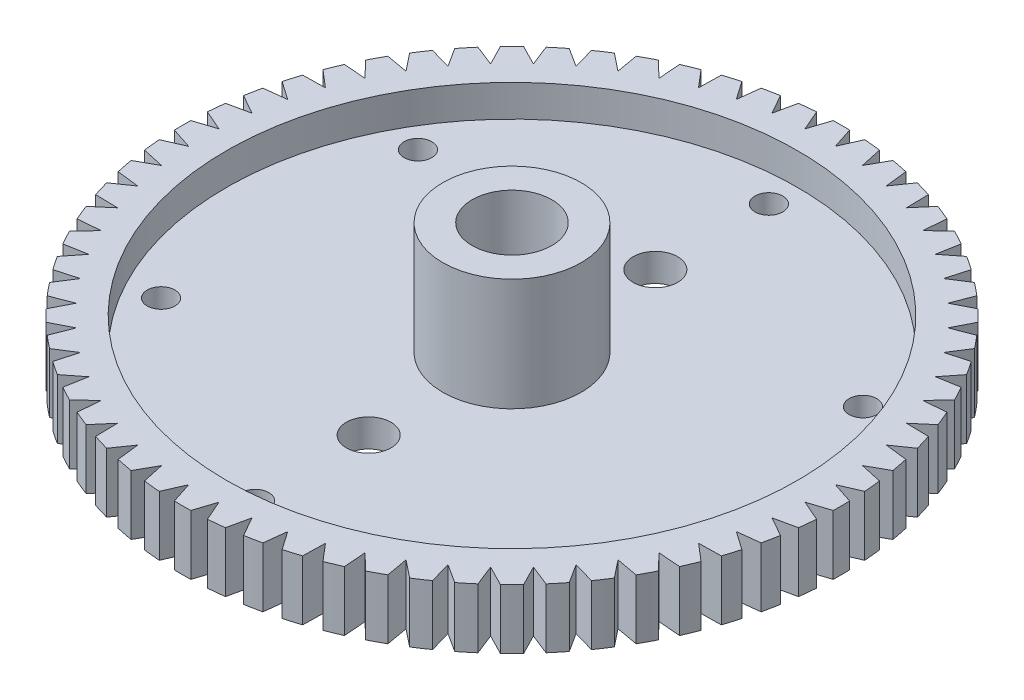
from build123d import *

# Parameters (mm, degrees)
SKETCH1_R           = 3.175
SKETCH1_R_2         = 1.1049
BOSS_EXTRUDE1_DEPTH = 4.7625
SKETCH2_R           = 5.5245
SKETCH2_R_2         = 3.175
BOSS_EXTRUDE2_DEPTH = 11.176
CUT_EXTRUDE2_START  = -2.54
SKETCH3_R           = 22.7711
SKETCH3_R_2         = 5.5245
CUT_EXTRUDE2_DEPTH  = 2.54
SKETCH4_R           = 1.778
CUT_EXTRUDE3_DEPTH  = 39.222050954


with BuildPart() as part:
    # Sketch1 → Boss-Extrude1 (new body)
    with BuildSketch(Plane(origin=(0, 0, 0), x_dir=(1, 0, 0), z_dir=(0, 1, 0))):
        with BuildLine():
            Line((-1.208701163, 24.570187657), (-0.656995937, 26.266217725))
            ThreePointArc((-0.656995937, 26.266217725), (0, 26.275071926), (0.657011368, 26.267448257))
            Line((0.657011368, 26.267448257), (1.205418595, 24.570348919))
            Line((1.205418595, 24.570348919), (1.920707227, 26.20413557))
            ThreePointArc((1.920707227, 26.20413557), (2.575407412, 26.148550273), (3.228507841, 26.076564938))
            Line((3.228507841, 26.076564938), (3.607929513, 24.33388429))
            Line((3.607929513, 24.33388429), (4.47991293, 25.889693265))
            ThreePointArc((4.47991293, 25.889693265), (5.126012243, 25.770203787), (5.768912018, 25.634550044))
            Line((5.768912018, 25.634550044), (5.975694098, 23.863071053))
            Line((5.975694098, 23.863071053), (6.995974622, 25.325919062))
            ThreePointArc((6.995974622, 25.325919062), (7.627250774, 25.14367615), (8.253758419, 24.94566042))
            Line((8.253758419, 24.94566042), (8.285909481, 23.162443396))
            Line((8.285909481, 23.162443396), (9.444661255, 24.518242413))
            ThreePointArc((9.444661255, 24.518242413), (10.05503471, 24.275001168), (10.659116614, 24.01653045))
            Line((10.659116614, 24.01653045), (10.516327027, 22.238748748))
            Line((10.516327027, 22.238748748), (11.802390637, 23.474441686))
            ThreePointArc((11.802390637, 23.474441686), (12.385983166, 23.172544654), (12.961821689, 22.856108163))
            Line((12.961821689, 22.856108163), (12.645466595, 21.100882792))
            Line((12.645466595, 21.100882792), (14.046456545, 22.204569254))
            ThreePointArc((14.046456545, 22.204569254), (14.597647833, 21.846923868), (15.139697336, 21.475569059))
            Line((15.139697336, 21.475569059), (14.652823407, 19.7598038))
            Line((14.652823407, 19.7598038), (16.155247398, 20.720854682))
            ThreePointArc((16.155247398, 20.720854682), (16.668729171, 20.310905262), (17.171769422, 19.888208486))
            Line((17.171769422, 19.888208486), (16.519065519, 18.228427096))
            Line((16.519065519, 18.228427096), (18.108454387, 19.037586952))
            ThreePointArc((18.108454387, 19.037586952), (18.579281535, 18.579281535), (19.03846798, 18.109313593))
            Line((19.03846798, 18.109313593), (18.22622, 16.521500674))
            Line((18.22622, 16.521500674), (19.887267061, 17.170976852))
            ThreePointArc((19.887267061, 17.170976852), (20.310905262, 16.668729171), (20.721815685, 16.15601611))
            Line((20.721815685, 16.15601611), (19.757846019, 14.655463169))
            Line((19.757846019, 14.655463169), (21.474554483, 15.139000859))
            ThreePointArc((21.474554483, 15.139000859), (21.846923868, 14.597647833), (22.205600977, 14.047127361))
            Line((22.205600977, 14.047127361), (21.09919318, 12.648285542))
            Line((21.09919318, 12.648285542), (22.855030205, 12.961228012))
            ThreePointArc((22.855030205, 12.961228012), (23.172544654, 12.385983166), (23.475534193, 11.802957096))
            Line((23.475534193, 11.802957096), (22.237343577, 10.519298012))
            Line((22.237343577, 10.519298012), (24.015399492, 10.658631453))
            ThreePointArc((24.015399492, 10.658631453), (24.275001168, 10.05503471), (24.519385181, 9.445117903))
            Line((24.519385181, 9.445117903), (23.161336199, 8.289003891))
            Line((23.161336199, 8.289003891), (24.944487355, 8.253386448))
            ThreePointArc((24.944487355, 8.253386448), (25.14367615, 7.627250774), (25.327101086, 6.99631706))
            Line((25.327101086, 6.99631706), (23.862272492, 5.978882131))
            Line((23.862272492, 5.978882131), (25.633346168, 5.768656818))
            ThreePointArc((25.633346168, 5.768656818), (25.770203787, 5.126012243), (25.890903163, 4.48013786))
            Line((25.890903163, 4.48013786), (24.333402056, 3.611180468))
            Line((24.333402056, 3.611180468), (26.075341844, 3.228371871))
            ThreePointArc((26.075341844, 3.228371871), (26.148550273, 2.575407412), (26.205361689, 1.920812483))
            Line((26.205361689, 1.920812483), (24.570187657, 1.208701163))
            Line((24.570187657, 1.208701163), (26.266217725, 0.656995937))
            ThreePointArc((26.266217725, 0.656995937), (26.275071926, 0), (26.267448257, -0.657011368))
            Line((26.267448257, -0.657011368), (24.570348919, -1.205418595))
            Line((24.570348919, -1.205418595), (26.20413557, -1.920707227))
            ThreePointArc((26.20413557, -1.920707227), (26.148550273, -2.575407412), (26.076564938, -3.228507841))
            Line((26.076564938, -3.228507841), (24.33388429, -3.607929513))
            Line((24.33388429, -3.607929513), (25.889693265, -4.47991293))
            ThreePointArc((25.889693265, -4.47991293), (25.770203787, -5.126012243), (25.634550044, -5.768912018))
            Line((25.634550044, -5.768912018), (23.863071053, -5.975694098))
            Line((23.863071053, -5.975694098), (25.325919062, -6.995974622))
            ThreePointArc((25.325919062, -6.995974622), (25.14367615, -7.627250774), (24.94566042, -8.253758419))
            Line((24.94566042, -8.253758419), (23.162443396, -8.285909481))
            Line((23.162443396, -8.285909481), (24.518242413, -9.444661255))
            ThreePointArc((24.518242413, -9.444661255), (24.275001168, -10.05503471), (24.01653045, -10.659116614))
            Line((24.01653045, -10.659116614), (22.238748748, -10.516327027))
            Line((22.238748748, -10.516327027), (23.474441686, -11.802390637))
            ThreePointArc((23.474441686, -11.802390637), (23.172544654, -12.385983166), (22.856108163, -12.961821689))
            Line((22.856108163, -12.961821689), (21.100882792, -12.645466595))
            Line((21.100882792, -12.645466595), (22.204569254, -14.046456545))
            ThreePointArc((22.204569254, -14.046456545), (21.846923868, -14.597647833), (21.475569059, -15.139697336))
            Line((21.475569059, -15.139697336), (19.7598038, -14.652823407))
            Line((19.7598038, -14.652823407), (20.720854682, -16.155247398))
            ThreePointArc((20.720854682, -16.155247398), (20.310905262, -16.668729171), (19.888208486, -17.171769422))
            Line((19.888208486, -17.171769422), (18.228427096, -16.519065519))
            Line((18.228427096, -16.519065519), (19.037586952, -18.108454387))
            ThreePointArc((19.037586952, -18.108454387), (18.579281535, -18.579281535), (18.109313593, -19.03846798))
            Line((18.109313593, -19.03846798), (16.521500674, -18.22622))
            Line((16.521500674, -18.22622), (17.170976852, -19.887267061))
            ThreePointArc((17.170976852, -19.887267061), (16.668729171, -20.310905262), (16.15601611, -20.721815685))
            Line((16.15601611, -20.721815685), (14.655463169, -19.757846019))
            Line((14.655463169, -19.757846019), (15.139000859, -21.474554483))
            ThreePointArc((15.139000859, -21.474554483), (14.597647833, -21.846923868), (14.047127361, -22.205600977))
            Line((14.047127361, -22.205600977), (12.648285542, -21.09919318))
            Line((12.648285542, -21.09919318), (12.961228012, -22.855030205))
            ThreePointArc((12.961228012, -22.855030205), (12.385983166, -23.172544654), (11.802957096, -23.475534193))
            Line((11.802957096, -23.475534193), (10.519298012, -22.237343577))
            Line((10.519298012, -22.237343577), (10.658631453, -24.015399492))
            ThreePointArc((10.658631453, -24.015399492), (10.05503471, -24.275001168), (9.445117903, -24.519385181))
            Line((9.445117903, -24.519385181), (8.289003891, -23.161336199))
            Line((8.289003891, -23.161336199), (8.253386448, -24.944487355))
            ThreePointArc((8.253386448, -24.944487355), (7.627250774, -25.14367615), (6.99631706, -25.327101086))
            Line((6.99631706, -25.327101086), (5.978882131, -23.862272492))
            Line((5.978882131, -23.862272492), (5.768656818, -25.633346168))
            ThreePointArc((5.768656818, -25.633346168), (5.126012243, -25.770203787), (4.48013786, -25.890903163))
            Line((4.48013786, -25.890903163), (3.611180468, -24.333402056))
            Line((3.611180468, -24.333402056), (3.228371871, -26.075341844))
            ThreePointArc((3.228371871, -26.075341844), (2.575407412, -26.148550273), (1.920812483, -26.205361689))
            Line((1.920812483, -26.205361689), (1.208701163, -24.570187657))
            Line((1.208701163, -24.570187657), (0.656995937, -26.266217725))
            ThreePointArc((0.656995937, -26.266217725), (0, -26.275071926), (-0.657011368, -26.267448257))
            Line((-0.657011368, -26.267448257), (-1.205418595, -24.570348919))
            Line((-1.205418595, -24.570348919), (-1.920707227, -26.20413557))
            ThreePointArc((-1.920707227, -26.20413557), (-2.575407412, -26.148550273), (-3.228507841, -26.076564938))
            Line((-3.228507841, -26.076564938), (-3.607929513, -24.33388429))
            Line((-3.607929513, -24.33388429), (-4.47991293, -25.889693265))
            ThreePointArc((-4.47991293, -25.889693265), (-5.126012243, -25.770203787), (-5.768912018, -25.634550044))
            Line((-5.768912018, -25.634550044), (-5.975694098, -23.863071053))
            Line((-5.975694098, -23.863071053), (-6.995974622, -25.325919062))
            ThreePointArc((-6.995974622, -25.325919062), (-7.627250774, -25.14367615), (-8.253758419, -24.94566042))
            Line((-8.253758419, -24.94566042), (-8.285909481, -23.162443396))
            Line((-8.285909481, -23.162443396), (-9.444661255, -24.518242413))
            ThreePointArc((-9.444661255, -24.518242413), (-10.05503471, -24.275001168), (-10.659116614, -24.01653045))
            Line((-10.659116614, -24.01653045), (-10.516327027, -22.238748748))
            Line((-10.516327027, -22.238748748), (-11.802390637, -23.474441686))
            ThreePointArc((-11.802390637, -23.474441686), (-12.385983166, -23.172544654), (-12.961821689, -22.856108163))
            Line((-12.961821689, -22.856108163), (-12.645466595, -21.100882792))
            Line((-12.645466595, -21.100882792), (-14.046456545, -22.204569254))
            ThreePointArc((-14.046456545, -22.204569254), (-14.597647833, -21.846923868), (-15.139697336, -21.475569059))
            Line((-15.139697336, -21.475569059), (-14.652823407, -19.7598038))
            Line((-14.652823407, -19.7598038), (-16.155247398, -20.720854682))
            ThreePointArc((-16.155247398, -20.720854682), (-16.668729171, -20.310905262), (-17.171769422, -19.888208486))
            Line((-17.171769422, -19.888208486), (-16.519065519, -18.228427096))
            Line((-16.519065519, -18.228427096), (-18.108454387, -19.037586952))
            ThreePointArc((-18.108454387, -19.037586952), (-18.579281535, -18.579281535), (-19.03846798, -18.109313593))
            Line((-19.03846798, -18.109313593), (-18.22622, -16.521500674))
            Line((-18.22622, -16.521500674), (-19.887267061, -17.170976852))
            ThreePointArc((-19.887267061, -17.170976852), (-20.310905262, -16.668729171), (-20.721815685, -16.15601611))
            Line((-20.721815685, -16.15601611), (-19.757846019, -14.655463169))
            Line((-19.757846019, -14.655463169), (-21.474554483, -15.139000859))
            ThreePointArc((-21.474554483, -15.139000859), (-21.846923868, -14.597647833), (-22.205600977, -14.047127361))
            Line((-22.205600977, -14.047127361), (-21.09919318, -12.648285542))
            Line((-21.09919318, -12.648285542), (-22.855030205, -12.961228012))
            ThreePointArc((-22.855030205, -12.961228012), (-23.172544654, -12.385983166), (-23.475534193, -11.802957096))
            Line((-23.475534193, -11.802957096), (-22.237343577, -10.519298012))
            Line((-22.237343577, -10.519298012), (-24.015399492, -10.658631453))
            ThreePointArc((-24.015399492, -10.658631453), (-24.275001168, -10.05503471), (-24.519385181, -9.445117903))
            Line((-24.519385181, -9.445117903), (-23.161336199, -8.289003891))
            Line((-23.161336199, -8.289003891), (-24.944487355, -8.253386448))
            ThreePointArc((-24.944487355, -8.253386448), (-25.14367615, -7.627250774), (-25.327101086, -6.99631706))
            Line((-25.327101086, -6.99631706), (-23.862272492, -5.978882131))
            Line((-23.862272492, -5.978882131), (-25.633346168, -5.768656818))
            ThreePointArc((-25.633346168, -5.768656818), (-25.770203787, -5.126012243), (-25.890903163, -4.48013786))
            Line((-25.890903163, -4.48013786), (-24.333402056, -3.611180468))
            Line((-24.333402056, -3.611180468), (-26.075341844, -3.228371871))
            ThreePointArc((-26.075341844, -3.228371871), (-26.148550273, -2.575407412), (-26.205361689, -1.920812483))
            Line((-26.205361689, -1.920812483), (-24.570187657, -1.208701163))
            Line((-24.570187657, -1.208701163), (-26.266217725, -0.656995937))
            ThreePointArc((-26.266217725, -0.656995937), (-26.275071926, 0), (-26.267448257, 0.657011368))
            Line((-26.267448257, 0.657011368), (-24.570348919, 1.205418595))
            Line((-24.570348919, 1.205418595), (-26.20413557, 1.920707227))
            ThreePointArc((-26.20413557, 1.920707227), (-26.148550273, 2.575407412), (-26.076564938, 3.228507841))
            Line((-26.076564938, 3.228507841), (-24.33388429, 3.607929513))
            Line((-24.33388429, 3.607929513), (-25.889693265, 4.47991293))
            ThreePointArc((-25.889693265, 4.47991293), (-25.770203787, 5.126012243), (-25.634550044, 5.768912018))
            Line((-25.634550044, 5.768912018), (-23.863071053, 5.975694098))
            Line((-23.863071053, 5.975694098), (-25.325919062, 6.995974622))
            ThreePointArc((-25.325919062, 6.995974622), (-25.14367615, 7.627250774), (-24.94566042, 8.253758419))
            Line((-24.94566042, 8.253758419), (-23.162443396, 8.285909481))
            Line((-23.162443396, 8.285909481), (-24.518242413, 9.444661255))
            ThreePointArc((-24.518242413, 9.444661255), (-24.275001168, 10.05503471), (-24.01653045, 10.659116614))
            Line((-24.01653045, 10.659116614), (-22.238748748, 10.516327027))
            Line((-22.238748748, 10.516327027), (-23.474441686, 11.802390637))
            ThreePointArc((-23.474441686, 11.802390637), (-23.172544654, 12.385983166), (-22.856108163, 12.961821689))
            Line((-22.856108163, 12.961821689), (-21.100882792, 12.645466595))
            Line((-21.100882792, 12.645466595), (-22.204569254, 14.046456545))
            ThreePointArc((-22.204569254, 14.046456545), (-21.846923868, 14.597647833), (-21.475569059, 15.139697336))
            Line((-21.475569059, 15.139697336), (-19.7598038, 14.652823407))
            Line((-19.7598038, 14.652823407), (-20.720854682, 16.155247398))
            ThreePointArc((-20.720854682, 16.155247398), (-20.310905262, 16.668729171), (-19.888208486, 17.171769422))
            Line((-19.888208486, 17.171769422), (-18.228427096, 16.519065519))
            Line((-18.228427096, 16.519065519), (-19.037586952, 18.108454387))
            ThreePointArc((-19.037586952, 18.108454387), (-18.579281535, 18.579281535), (-18.109313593, 19.03846798))
            Line((-18.109313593, 19.03846798), (-16.521500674, 18.22622))
            Line((-16.521500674, 18.22622), (-17.170976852, 19.887267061))
            ThreePointArc((-17.170976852, 19.887267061), (-16.668729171, 20.310905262), (-16.15601611, 20.721815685))
            Line((-16.15601611, 20.721815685), (-14.655463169, 19.757846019))
            Line((-14.655463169, 19.757846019), (-15.139000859, 21.474554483))
            ThreePointArc((-15.139000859, 21.474554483), (-14.597647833, 21.846923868), (-14.047127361, 22.205600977))
            Line((-14.047127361, 22.205600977), (-12.648285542, 21.09919318))
            Line((-12.648285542, 21.09919318), (-12.961228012, 22.855030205))
            ThreePointArc((-12.961228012, 22.855030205), (-12.385983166, 23.172544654), (-11.802957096, 23.475534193))
            Line((-11.802957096, 23.475534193), (-10.519298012, 22.237343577))
            Line((-10.519298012, 22.237343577), (-10.658631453, 24.015399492))
            ThreePointArc((-10.658631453, 24.015399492), (-10.05503471, 24.275001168), (-9.445117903, 24.519385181))
            Line((-9.445117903, 24.519385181), (-8.289003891, 23.161336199))
            Line((-8.289003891, 23.161336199), (-8.253386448, 24.944487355))
            ThreePointArc((-8.253386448, 24.944487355), (-7.627250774, 25.14367615), (-6.99631706, 25.327101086))
            Line((-6.99631706, 25.327101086), (-5.978882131, 23.862272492))
            Line((-5.978882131, 23.862272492), (-5.768656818, 25.633346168))
            ThreePointArc((-5.768656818, 25.633346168), (-5.126012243, 25.770203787), (-4.48013786, 25.890903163))
            Line((-4.48013786, 25.890903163), (-3.611180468, 24.333402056))
            Line((-3.611180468, 24.333402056), (-3.228371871, 26.075341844))
            ThreePointArc((-3.228371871, 26.075341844), (-2.575407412, 26.148550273), (-1.920812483, 26.205361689))
            Line((-1.920812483, 26.205361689), (-1.208701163, 24.570187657))
        make_face()
        with Locations(Location((0, 0, 0), (0, 0, 90))):
            Circle(SKETCH1_R, mode=Mode.SUBTRACT)
        with Locations(Location((0, 20.4851, 0), (0, 0, 90))):
            Circle(SKETCH1_R_2, mode=Mode.SUBTRACT)
        with Locations(Location((17.740616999, 10.24255, 0), (0, 0, 90))):
            Circle(SKETCH1_R_2, mode=Mode.SUBTRACT)
        with Locations(Location((17.740616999, -10.24255, 0), (0, 0, 90))):
            Circle(SKETCH1_R_2, mode=Mode.SUBTRACT)
        with Locations(Location((0, -20.4851, 0), (0, 0, 90))):
            Circle(SKETCH1_R_2, mode=Mode.SUBTRACT)
        with Locations(Location((-17.740616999, -10.24255, 0), (0, 0, 90))):
            Circle(SKETCH1_R_2, mode=Mode.SUBTRACT)
        with Locations(Location((-17.740616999, 10.24255, 0), (0, 0, 90))):
            Circle(SKETCH1_R_2, mode=Mode.SUBTRACT)
    extrude(amount=BOSS_EXTRUDE1_DEPTH)

    # Sketch2 → Boss-Extrude2 (add)
    with BuildSketch(Plane(origin=(0, 0, 0), x_dir=(1, 0, 0), z_dir=(0, 1, 0))):
        with Locations(Location((0, 0, 0), (0, 0, 90))):
            Circle(SKETCH2_R)
        with Locations(Location((0, 0, 0), (0, 0, 90))):
            Circle(SKETCH2_R_2, mode=Mode.SUBTRACT)
    extrude(amount=BOSS_EXTRUDE2_DEPTH)

    # Sketch3 → Cut-Extrude2 (cut)
    with BuildSketch(Plane(origin=(0, 4.7625, 0), x_dir=(1, 0, 0), z_dir=(0, 1, 0)).offset(CUT_EXTRUDE2_START)):
        with Locations(Location((0, 0, 0), (0, 0, 270))):
            Circle(SKETCH3_R)
        with Locations(Location((0, 0, 0), (0, 0, 270))):
            Circle(SKETCH3_R_2, mode=Mode.SUBTRACT)
    extrude(amount=CUT_EXTRUDE2_DEPTH, mode=Mode.SUBTRACT)

    # Sketch4 → Cut-Extrude3 (cut, through all)
    with BuildSketch(Plane(origin=(0, 2.2225, 0), x_dir=(1, 0, 0), z_dir=(0, 1, 0))):
        with Locations(Location((0, 11.43, 0), (0, 0, 270))):
            Circle(SKETCH4_R)
        with Locations(Location((0, -11.43, 0), (0, 0, 270))):
            Circle(SKETCH4_R)
    extrude(amount=-CUT_EXTRUDE3_DEPTH, mode=Mode.SUBTRACT)


solid = part.part
